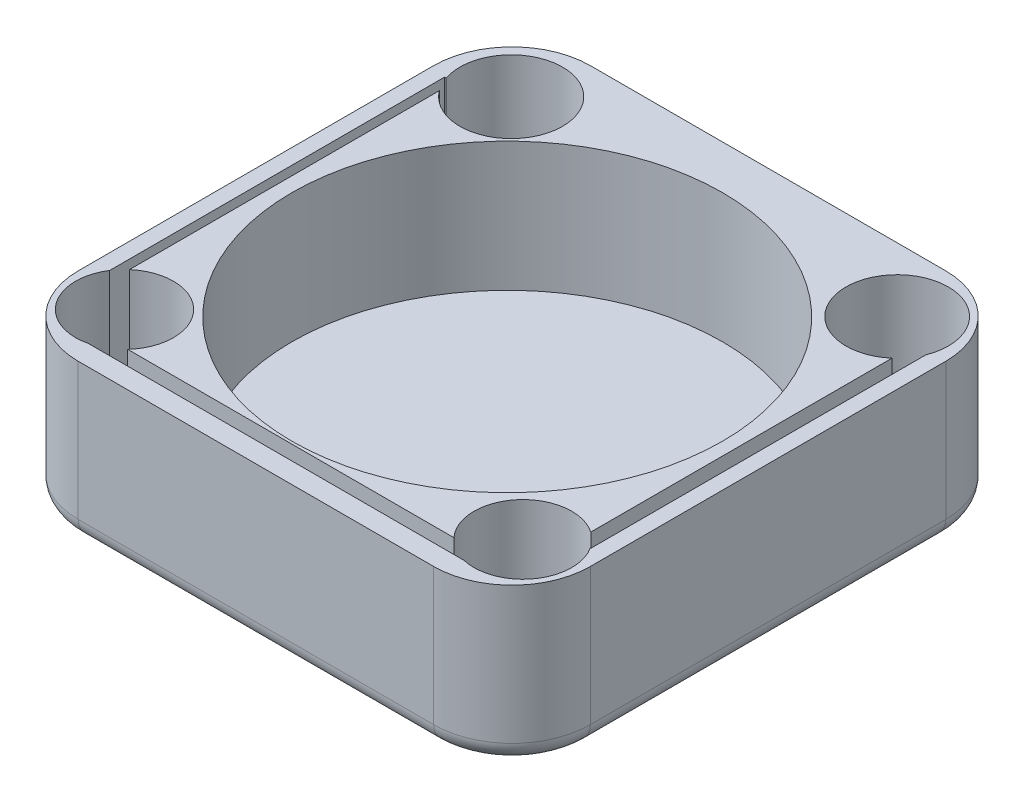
ISO-10303-21;
HEADER;
FILE_DESCRIPTION(('STEP AP214'),'2;1');
FILE_NAME('part.step','',(''),(''),'','','');
FILE_SCHEMA(('AUTOMOTIVE_DESIGN { 1 0 10303 214 1 1 1 1 }'));
ENDSEC;
DATA;
#1=APPLICATION_CONTEXT('core data for automotive mechanical design processes');
#2=APPLICATION_PROTOCOL_DEFINITION('international standard','automotive_design',2000,#1);
#3=PRODUCT_CONTEXT('',#1,'mechanical');
#4=PRODUCT('Part','Part','',(#3));
#5=PRODUCT_RELATED_PRODUCT_CATEGORY('part','',(#4));
#6=PRODUCT_DEFINITION_FORMATION('','',#4);
#7=PRODUCT_DEFINITION_CONTEXT('part definition',#1,'design');
#8=PRODUCT_DEFINITION('design','',#6,#7);
#9=PRODUCT_DEFINITION_SHAPE('','',#8);
#10=(LENGTH_UNIT() NAMED_UNIT(*) SI_UNIT(.MILLI.,.METRE.));
#11=(NAMED_UNIT(*) PLANE_ANGLE_UNIT() SI_UNIT($,.RADIAN.));
#12=(NAMED_UNIT(*) SI_UNIT($,.STERADIAN.) SOLID_ANGLE_UNIT());
#13=UNCERTAINTY_MEASURE_WITH_UNIT(LENGTH_MEASURE(1.E-05),#10,'distance_accuracy_value','');
#14=(GEOMETRIC_REPRESENTATION_CONTEXT(3) GLOBAL_UNCERTAINTY_ASSIGNED_CONTEXT((#13)) GLOBAL_UNIT_ASSIGNED_CONTEXT((#10,
#11,#12)) REPRESENTATION_CONTEXT('',''));
#15=CARTESIAN_POINT('',(0.,0.,0.));
#16=DIRECTION('',(0.,0.,1.));
#17=DIRECTION('',(1.,0.,0.));
#18=AXIS2_PLACEMENT_3D('',#15,#16,#17);
#19=CARTESIAN_POINT('',(-18.3773022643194,7.00000000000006,61.4690769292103));
#20=DIRECTION('',(0.,1.,0.));
#21=DIRECTION('',(0.,0.,1.));
#22=AXIS2_PLACEMENT_3D('',#19,#20,#21);
#23=CYLINDRICAL_SURFACE('',#22,12.498125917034);
#24=CARTESIAN_POINT('',(-18.3773022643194,40.0000000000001,61.4690769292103));
#25=DIRECTION('',(0.,1.,0.));
#26=DIRECTION('',(0.,0.,1.));
#27=AXIS2_PLACEMENT_3D('',#24,#25,#26);
#28=CIRCLE('',#27,12.498125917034);
#29=CARTESIAN_POINT('',(-9.14142279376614,40.0000000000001,69.8893905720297));
#30=VERTEX_POINT('',#29);
#31=CARTESIAN_POINT('',(-26.5583823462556,40.0000000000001,52.02063366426));
#32=VERTEX_POINT('',#31);
#33=EDGE_CURVE('E656',#30,#32,#28,.T.);
#34=ORIENTED_EDGE('',*,*,#33,.T.);
#35=DIRECTION('',(0.,1.,0.));
#36=VECTOR('',#35,1.);
#37=CARTESIAN_POINT('',(-26.5583823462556,7.00000000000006,52.02063366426));
#38=LINE('',#37,#36);
#39=CARTESIAN_POINT('',(-26.5583823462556,7.00000000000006,52.02063366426));
#40=VERTEX_POINT('',#39);
#41=EDGE_CURVE('E11',#32,#40,#38,.F.);
#42=ORIENTED_EDGE('',*,*,#41,.T.);
#43=CARTESIAN_POINT('',(-18.3773022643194,7.00000000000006,61.4690769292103));
#44=DIRECTION('',(0.,1.,0.));
#45=DIRECTION('',(0.,0.,1.));
#46=AXIS2_PLACEMENT_3D('',#43,#44,#45);
#47=CIRCLE('',#46,12.498125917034);
#48=CARTESIAN_POINT('',(-9.14142279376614,7.00000000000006,69.8893905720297));
#49=VERTEX_POINT('',#48);
#50=EDGE_CURVE('E660',#49,#40,#47,.T.);
#51=ORIENTED_EDGE('',*,*,#50,.F.);
#52=DIRECTION('',(0.,1.,0.));
#53=VECTOR('',#52,1.);
#54=CARTESIAN_POINT('',(-9.14142279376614,7.00000000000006,69.8893905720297));
#55=LINE('',#54,#53);
#56=EDGE_CURVE('E619',#49,#30,#55,.T.);
#57=ORIENTED_EDGE('',*,*,#56,.T.);
#58=EDGE_LOOP('',(#34,#42,#51,#57));
#59=FACE_BOUND('',#58,.T.);
#60=ADVANCED_FACE('F351',(#59),#23,.F.);
#61=CARTESIAN_POINT('',(83.3776914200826,7.00000000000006,61.4690769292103));
#62=DIRECTION('',(0.,1.,0.));
#63=DIRECTION('',(0.,0.,1.));
#64=AXIS2_PLACEMENT_3D('',#61,#62,#63);
#65=CYLINDRICAL_SURFACE('',#64,12.479433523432);
#66=CARTESIAN_POINT('',(83.3776914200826,7.00000000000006,61.4690769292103));
#67=DIRECTION('',(0.,1.,0.));
#68=DIRECTION('',(0.,0.,1.));
#69=AXIS2_PLACEMENT_3D('',#66,#67,#68);
#70=CIRCLE('',#69,12.479433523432);
#71=CARTESIAN_POINT('',(80.5259033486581,7.00000000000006,73.6182977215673));
#72=VERTEX_POINT('',#71);
#73=CARTESIAN_POINT('',(93.8772460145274,7.00000000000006,54.7240332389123));
#74=VERTEX_POINT('',#73);
#75=EDGE_CURVE('E666',#72,#74,#70,.T.);
#76=ORIENTED_EDGE('',*,*,#75,.F.);
#77=DIRECTION('',(0.,1.,0.));
#78=VECTOR('',#77,1.);
#79=CARTESIAN_POINT('',(80.5259033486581,7.00000000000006,73.6182977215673));
#80=LINE('',#79,#78);
#81=CARTESIAN_POINT('',(80.5259033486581,40.0000000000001,73.6182977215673));
#82=VERTEX_POINT('',#81);
#83=EDGE_CURVE('E616',#72,#82,#80,.T.);
#84=ORIENTED_EDGE('',*,*,#83,.T.);
#85=CARTESIAN_POINT('',(83.3776914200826,40.0000000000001,61.4690769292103));
#86=DIRECTION('',(0.,1.,0.));
#87=DIRECTION('',(0.,0.,1.));
#88=AXIS2_PLACEMENT_3D('',#85,#86,#87);
#89=CIRCLE('',#88,12.479433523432);
#90=CARTESIAN_POINT('',(93.8772460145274,40.0000000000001,54.7240332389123));
#91=VERTEX_POINT('',#90);
#92=EDGE_CURVE('E662',#82,#91,#89,.T.);
#93=ORIENTED_EDGE('',*,*,#92,.T.);
#94=DIRECTION('',(0.,1.,0.));
#95=VECTOR('',#94,1.);
#96=CARTESIAN_POINT('',(93.8772460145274,7.00000000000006,54.7240332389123));
#97=LINE('',#96,#95);
#98=EDGE_CURVE('E653',#91,#74,#97,.F.);
#99=ORIENTED_EDGE('',*,*,#98,.T.);
#100=EDGE_LOOP('',(#76,#84,#93,#99));
#101=FACE_BOUND('',#100,.T.);
#102=ADVANCED_FACE('F927',(#101),#65,.F.);
#103=CARTESIAN_POINT('',(97.9730137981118,0.,78.8437182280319));
#104=DIRECTION('',(0.,-1.,0.));
#105=DIRECTION('',(0.,0.,-1.));
#106=AXIS2_PLACEMENT_3D('',#103,#104,#105);
#107=PLANE('',#106);
#108=DIRECTION('',(0.,0.,-1.));
#109=VECTOR('',#108,1.);
#110=CARTESIAN_POINT('',(-12.8300072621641,0.,-31.959302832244));
#111=LINE('',#110,#109);
#112=CARTESIAN_POINT('',(-12.8300072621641,0.,58.8437182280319));
#113=VERTEX_POINT('',#112);
#114=CARTESIAN_POINT('',(-12.8300072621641,0.,-31.959302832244));
#115=VERTEX_POINT('',#114);
#116=EDGE_CURVE('E680',#113,#115,#111,.T.);
#117=ORIENTED_EDGE('',*,*,#116,.F.);
#118=DIRECTION('',(-1.,0.,0.));
#119=VECTOR('',#118,1.);
#120=CARTESIAN_POINT('',(-12.8300072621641,0.,58.8437182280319));
#121=LINE('',#120,#119);
#122=CARTESIAN_POINT('',(-2.54679560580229,0.,58.8437182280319));
#123=VERTEX_POINT('',#122);
#124=EDGE_CURVE('E688',#123,#113,#121,.T.);
#125=ORIENTED_EDGE('',*,*,#124,.F.);
#126=DIRECTION('',(0.,0.,1.));
#127=VECTOR('',#126,1.);
#128=CARTESIAN_POINT('',(-2.54679560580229,0.,-31.959302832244));
#129=LINE('',#128,#127);
#130=CARTESIAN_POINT('',(-2.54679560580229,0.,-31.959302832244));
#131=VERTEX_POINT('',#130);
#132=EDGE_CURVE('E685',#131,#123,#129,.T.);
#133=ORIENTED_EDGE('',*,*,#132,.F.);
#134=DIRECTION('',(1.,0.,0.));
#135=VECTOR('',#134,1.);
#136=CARTESIAN_POINT('',(-12.8300072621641,0.,-31.959302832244));
#137=LINE('',#136,#135);
#138=EDGE_CURVE('E682',#115,#131,#137,.T.);
#139=ORIENTED_EDGE('',*,*,#138,.F.);
#140=EDGE_LOOP('',(#117,#125,#133,#139));
#141=FACE_BOUND('',#140,.T.);
#142=DIRECTION('',(0.,0.,1.));
#143=VECTOR('',#142,1.);
#144=CARTESIAN_POINT('',(77.9730137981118,0.,-31.959302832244));
#145=LINE('',#144,#143);
#146=CARTESIAN_POINT('',(77.9730137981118,0.,-31.959302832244));
#147=VERTEX_POINT('',#146);
#148=CARTESIAN_POINT('',(77.9730137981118,0.,58.8437182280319));
#149=VERTEX_POINT('',#148);
#150=EDGE_CURVE('E706',#147,#149,#145,.T.);
#151=ORIENTED_EDGE('',*,*,#150,.F.);
#152=DIRECTION('',(1.,0.,0.));
#153=VECTOR('',#152,1.);
#154=CARTESIAN_POINT('',(77.9730137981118,0.,-31.959302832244));
#155=LINE('',#154,#153);
#156=CARTESIAN_POINT('',(67.8391359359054,0.,-31.959302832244));
#157=VERTEX_POINT('',#156);
#158=EDGE_CURVE('E720',#157,#147,#155,.T.);
#159=ORIENTED_EDGE('',*,*,#158,.F.);
#160=DIRECTION('',(0.,0.,-1.));
#161=VECTOR('',#160,1.);
#162=CARTESIAN_POINT('',(67.8391359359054,0.,-31.959302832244));
#163=LINE('',#162,#161);
#164=CARTESIAN_POINT('',(67.8391359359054,0.,58.8437182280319));
#165=VERTEX_POINT('',#164);
#166=EDGE_CURVE('E717',#165,#157,#163,.T.);
#167=ORIENTED_EDGE('',*,*,#166,.F.);
#168=DIRECTION('',(-1.,0.,0.));
#169=VECTOR('',#168,1.);
#170=CARTESIAN_POINT('',(77.9730137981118,0.,58.8437182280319));
#171=LINE('',#170,#169);
#172=EDGE_CURVE('E714',#149,#165,#171,.T.);
#173=ORIENTED_EDGE('',*,*,#172,.F.);
#174=EDGE_LOOP('',(#151,#159,#167,#173));
#175=FACE_BOUND('',#174,.T.);
#176=CARTESIAN_POINT('',(77.9730137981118,0.,58.8437182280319));
#177=DIRECTION('',(0.,-1.,0.));
#178=DIRECTION('',(0.,0.,-1.));
#179=AXIS2_PLACEMENT_3D('',#176,#177,#178);
#180=CIRCLE('',#179,15.);
#181=CARTESIAN_POINT('',(77.9730137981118,0.,73.8437182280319));
#182=VERTEX_POINT('',#181);
#183=CARTESIAN_POINT('',(92.9730137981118,0.,58.8437182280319));
#184=VERTEX_POINT('',#183);
#185=EDGE_CURVE('E834',#182,#184,#180,.F.);
#186=ORIENTED_EDGE('',*,*,#185,.F.);
#187=DIRECTION('',(1.,0.,0.));
#188=VECTOR('',#187,1.);
#189=CARTESIAN_POINT('',(-12.8300072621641,0.,73.8437182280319));
#190=LINE('',#189,#188);
#191=CARTESIAN_POINT('',(-12.8300072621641,0.,73.8437182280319));
#192=VERTEX_POINT('',#191);
#193=EDGE_CURVE('E809',#182,#192,#190,.F.);
#194=ORIENTED_EDGE('',*,*,#193,.T.);
#195=CARTESIAN_POINT('',(-12.8300072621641,0.,58.8437182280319));
#196=DIRECTION('',(0.,-1.,0.));
#197=DIRECTION('',(0.,0.,-1.));
#198=AXIS2_PLACEMENT_3D('',#195,#196,#197);
#199=CIRCLE('',#198,15.);
#200=CARTESIAN_POINT('',(-27.8300072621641,0.,58.8437182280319));
#201=VERTEX_POINT('',#200);
#202=EDGE_CURVE('E811',#192,#201,#199,.T.);
#203=ORIENTED_EDGE('',*,*,#202,.T.);
#204=DIRECTION('',(0.,0.,1.));
#205=VECTOR('',#204,1.);
#206=CARTESIAN_POINT('',(-27.8300072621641,0.,-31.959302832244));
#207=LINE('',#206,#205);
#208=CARTESIAN_POINT('',(-27.8300072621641,0.,-31.959302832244));
#209=VERTEX_POINT('',#208);
#210=EDGE_CURVE('E813',#201,#209,#207,.F.);
#211=ORIENTED_EDGE('',*,*,#210,.T.);
#212=CARTESIAN_POINT('',(-12.8300072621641,0.,-31.959302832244));
#213=DIRECTION('',(0.,-1.,0.));
#214=DIRECTION('',(0.,0.,-1.));
#215=AXIS2_PLACEMENT_3D('',#212,#213,#214);
#216=CIRCLE('',#215,15.);
#217=CARTESIAN_POINT('',(-12.8300072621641,0.,-46.959302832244));
#218=VERTEX_POINT('',#217);
#219=EDGE_CURVE('E815',#209,#218,#216,.T.);
#220=ORIENTED_EDGE('',*,*,#219,.T.);
#221=DIRECTION('',(-1.,0.,0.));
#222=VECTOR('',#221,1.);
#223=CARTESIAN_POINT('',(77.9730137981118,0.,-46.959302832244));
#224=LINE('',#223,#222);
#225=CARTESIAN_POINT('',(77.9730137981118,0.,-46.959302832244));
#226=VERTEX_POINT('',#225);
#227=EDGE_CURVE('E802',#218,#226,#224,.F.);
#228=ORIENTED_EDGE('',*,*,#227,.T.);
#229=CARTESIAN_POINT('',(77.9730137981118,0.,-31.959302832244));
#230=DIRECTION('',(0.,-1.,0.));
#231=DIRECTION('',(0.,0.,-1.));
#232=AXIS2_PLACEMENT_3D('',#229,#230,#231);
#233=CIRCLE('',#232,15.);
#234=CARTESIAN_POINT('',(92.9730137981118,0.,-31.959302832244));
#235=VERTEX_POINT('',#234);
#236=EDGE_CURVE('E804',#226,#235,#233,.T.);
#237=ORIENTED_EDGE('',*,*,#236,.T.);
#238=DIRECTION('',(0.,0.,-1.));
#239=VECTOR('',#238,1.);
#240=CARTESIAN_POINT('',(92.9730137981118,0.,78.8437182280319));
#241=LINE('',#240,#239);
#242=EDGE_CURVE('E806',#235,#184,#241,.F.);
#243=ORIENTED_EDGE('',*,*,#242,.T.);
#244=EDGE_LOOP('',(#186,#194,#203,#211,#220,#228,#237,#243));
#245=FACE_BOUND('',#244,.T.);
#246=ADVANCED_FACE('F866',(#141,#175,#245),#107,.T.);
#247=CARTESIAN_POINT('',(97.9730137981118,40.0000000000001,-51.959302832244));
#248=DIRECTION('',(-1.,0.,0.));
#249=DIRECTION('',(0.,0.,1.));
#250=AXIS2_PLACEMENT_3D('',#247,#248,#249);
#251=PLANE('',#250);
#252=DIRECTION('',(0.,0.,-1.));
#253=VECTOR('',#252,1.);
#254=CARTESIAN_POINT('',(97.9730137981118,40.0000000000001,-51.959302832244));
#255=LINE('',#254,#253);
#256=CARTESIAN_POINT('',(97.9730137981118,40.0000000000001,58.8437182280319));
#257=VERTEX_POINT('',#256);
#258=CARTESIAN_POINT('',(97.9730137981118,40.0000000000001,-31.959302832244));
#259=VERTEX_POINT('',#258);
#260=EDGE_CURVE('E769',#257,#259,#255,.T.);
#261=ORIENTED_EDGE('',*,*,#260,.F.);
#262=DIRECTION('',(0.,-1.,0.));
#263=VECTOR('',#262,1.);
#264=CARTESIAN_POINT('',(97.9730137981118,40.0000000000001,58.8437182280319));
#265=LINE('',#264,#263);
#266=CARTESIAN_POINT('',(97.9730137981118,5.,58.8437182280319));
#267=VERTEX_POINT('',#266);
#268=EDGE_CURVE('E841',#257,#267,#265,.T.);
#269=ORIENTED_EDGE('',*,*,#268,.T.);
#270=DIRECTION('',(0.,0.,-1.));
#271=VECTOR('',#270,1.);
#272=CARTESIAN_POINT('',(97.9730137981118,5.,-31.959302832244));
#273=LINE('',#272,#271);
#274=CARTESIAN_POINT('',(97.9730137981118,5.,-31.959302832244));
#275=VERTEX_POINT('',#274);
#276=EDGE_CURVE('E828',#267,#275,#273,.T.);
#277=ORIENTED_EDGE('',*,*,#276,.T.);
#278=DIRECTION('',(0.,-1.,0.));
#279=VECTOR('',#278,1.);
#280=CARTESIAN_POINT('',(97.9730137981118,40.0000000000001,-31.959302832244));
#281=LINE('',#280,#279);
#282=EDGE_CURVE('E797',#275,#259,#281,.F.);
#283=ORIENTED_EDGE('',*,*,#282,.T.);
#284=EDGE_LOOP('',(#261,#269,#277,#283));
#285=FACE_BOUND('',#284,.T.);
#286=ADVANCED_FACE('F353',(#285),#251,.F.);
#287=CARTESIAN_POINT('',(97.9730137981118,40.0000000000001,-51.959302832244));
#288=DIRECTION('',(0.,0.,1.));
#289=DIRECTION('',(1.,0.,0.));
#290=AXIS2_PLACEMENT_3D('',#287,#288,#289);
#291=PLANE('',#290);
#292=DIRECTION('',(0.,-1.,0.));
#293=VECTOR('',#292,1.);
#294=CARTESIAN_POINT('',(77.9730137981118,40.0000000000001,-51.959302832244));
#295=LINE('',#294,#293);
#296=CARTESIAN_POINT('',(77.9730137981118,40.0000000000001,-51.959302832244));
#297=VERTEX_POINT('',#296);
#298=CARTESIAN_POINT('',(77.9730137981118,5.,-51.959302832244));
#299=VERTEX_POINT('',#298);
#300=EDGE_CURVE('E794',#297,#299,#295,.T.);
#301=ORIENTED_EDGE('',*,*,#300,.T.);
#302=DIRECTION('',(-1.,0.,0.));
#303=VECTOR('',#302,1.);
#304=CARTESIAN_POINT('',(-12.8300072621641,5.,-51.959302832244));
#305=LINE('',#304,#303);
#306=CARTESIAN_POINT('',(-12.8300072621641,5.,-51.959302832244));
#307=VERTEX_POINT('',#306);
#308=EDGE_CURVE('E832',#299,#307,#305,.T.);
#309=ORIENTED_EDGE('',*,*,#308,.T.);
#310=DIRECTION('',(0.,-1.,0.));
#311=VECTOR('',#310,1.);
#312=CARTESIAN_POINT('',(-12.8300072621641,40.0000000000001,-51.959302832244));
#313=LINE('',#312,#311);
#314=CARTESIAN_POINT('',(-12.8300072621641,40.0000000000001,-51.959302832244));
#315=VERTEX_POINT('',#314);
#316=EDGE_CURVE('E790',#307,#315,#313,.F.);
#317=ORIENTED_EDGE('',*,*,#316,.T.);
#318=DIRECTION('',(-1.,0.,0.));
#319=VECTOR('',#318,1.);
#320=CARTESIAN_POINT('',(97.9730137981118,40.0000000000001,-51.959302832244));
#321=LINE('',#320,#319);
#322=EDGE_CURVE('E771',#297,#315,#321,.T.);
#323=ORIENTED_EDGE('',*,*,#322,.F.);
#324=EDGE_LOOP('',(#301,#309,#317,#323));
#325=FACE_BOUND('',#324,.T.);
#326=ADVANCED_FACE('F880',(#325),#291,.F.);
#327=CARTESIAN_POINT('',(-32.8300072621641,40.0000000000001,-51.959302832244));
#328=DIRECTION('',(1.,0.,0.));
#329=DIRECTION('',(0.,0.,-1.));
#330=AXIS2_PLACEMENT_3D('',#327,#328,#329);
#331=PLANE('',#330);
#332=DIRECTION('',(0.,-1.,0.));
#333=VECTOR('',#332,1.);
#334=CARTESIAN_POINT('',(-32.8300072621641,40.0000000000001,-31.959302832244));
#335=LINE('',#334,#333);
#336=CARTESIAN_POINT('',(-32.8300072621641,40.0000000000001,-31.959302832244));
#337=VERTEX_POINT('',#336);
#338=CARTESIAN_POINT('',(-32.8300072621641,5.,-31.959302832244));
#339=VERTEX_POINT('',#338);
#340=EDGE_CURVE('E787',#337,#339,#335,.T.);
#341=ORIENTED_EDGE('',*,*,#340,.T.);
#342=DIRECTION('',(0.,0.,1.));
#343=VECTOR('',#342,1.);
#344=CARTESIAN_POINT('',(-32.8300072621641,5.,58.8437182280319));
#345=LINE('',#344,#343);
#346=CARTESIAN_POINT('',(-32.8300072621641,5.,58.8437182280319));
#347=VERTEX_POINT('',#346);
#348=EDGE_CURVE('E821',#339,#347,#345,.T.);
#349=ORIENTED_EDGE('',*,*,#348,.T.);
#350=DIRECTION('',(0.,-1.,0.));
#351=VECTOR('',#350,1.);
#352=CARTESIAN_POINT('',(-32.8300072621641,40.0000000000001,58.8437182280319));
#353=LINE('',#352,#351);
#354=CARTESIAN_POINT('',(-32.8300072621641,40.0000000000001,58.8437182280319));
#355=VERTEX_POINT('',#354);
#356=EDGE_CURVE('E783',#347,#355,#353,.F.);
#357=ORIENTED_EDGE('',*,*,#356,.T.);
#358=DIRECTION('',(0.,0.,1.));
#359=VECTOR('',#358,1.);
#360=CARTESIAN_POINT('',(-32.8300072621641,40.0000000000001,-51.959302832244));
#361=LINE('',#360,#359);
#362=EDGE_CURVE('E774',#337,#355,#361,.T.);
#363=ORIENTED_EDGE('',*,*,#362,.F.);
#364=EDGE_LOOP('',(#341,#349,#357,#363));
#365=FACE_BOUND('',#364,.T.);
#366=ADVANCED_FACE('F899',(#365),#331,.F.);
#367=CARTESIAN_POINT('',(97.9730137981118,40.0000000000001,78.8437182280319));
#368=DIRECTION('',(0.,0.,-1.));
#369=DIRECTION('',(-1.,0.,0.));
#370=AXIS2_PLACEMENT_3D('',#367,#368,#369);
#371=PLANE('',#370);
#372=DIRECTION('',(1.,0.,0.));
#373=VECTOR('',#372,1.);
#374=CARTESIAN_POINT('',(97.9730137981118,5.,78.8437182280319));
#375=LINE('',#374,#373);
#376=CARTESIAN_POINT('',(-12.8300072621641,5.,78.8437182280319));
#377=VERTEX_POINT('',#376);
#378=CARTESIAN_POINT('',(77.9730137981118,5.,78.8437182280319));
#379=VERTEX_POINT('',#378);
#380=EDGE_CURVE('E825',#377,#379,#375,.T.);
#381=ORIENTED_EDGE('',*,*,#380,.T.);
#382=DIRECTION('',(0.,-1.,0.));
#383=VECTOR('',#382,1.);
#384=CARTESIAN_POINT('',(77.9730137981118,40.0000000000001,78.8437182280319));
#385=LINE('',#384,#383);
#386=CARTESIAN_POINT('',(77.9730137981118,40.0000000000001,78.8437182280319));
#387=VERTEX_POINT('',#386);
#388=EDGE_CURVE('E843',#379,#387,#385,.F.);
#389=ORIENTED_EDGE('',*,*,#388,.T.);
#390=DIRECTION('',(1.,0.,0.));
#391=VECTOR('',#390,1.);
#392=CARTESIAN_POINT('',(97.9730137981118,40.0000000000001,78.8437182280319));
#393=LINE('',#392,#391);
#394=CARTESIAN_POINT('',(-12.8300072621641,40.0000000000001,78.8437182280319));
#395=VERTEX_POINT('',#394);
#396=EDGE_CURVE('E777',#395,#387,#393,.T.);
#397=ORIENTED_EDGE('',*,*,#396,.F.);
#398=DIRECTION('',(0.,-1.,0.));
#399=VECTOR('',#398,1.);
#400=CARTESIAN_POINT('',(-12.8300072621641,40.0000000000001,78.8437182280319));
#401=LINE('',#400,#399);
#402=EDGE_CURVE('E780',#395,#377,#401,.T.);
#403=ORIENTED_EDGE('',*,*,#402,.T.);
#404=EDGE_LOOP('',(#381,#389,#397,#403));
#405=FACE_BOUND('',#404,.T.);
#406=ADVANCED_FACE('F914',(#405),#371,.F.);
#407=CARTESIAN_POINT('',(97.9730137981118,40.0000000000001,78.8437182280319));
#408=DIRECTION('',(0.,-1.,0.));
#409=DIRECTION('',(0.,0.,-1.));
#410=AXIS2_PLACEMENT_3D('',#407,#408,#409);
#411=PLANE('',#410);
#412=CARTESIAN_POINT('',(-16.0509096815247,40.0000000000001,-34.9745824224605));
#413=DIRECTION('',(0.,1.,0.));
#414=DIRECTION('',(0.,0.,1.));
#415=AXIS2_PLACEMENT_3D('',#412,#413,#414);
#416=CIRCLE('',#415,13.119532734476);
#417=CARTESIAN_POINT('',(-26.5583823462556,40.0000000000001,-27.1186828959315));
#418=VERTEX_POINT('',#417);
#419=CARTESIAN_POINT('',(-28.4959855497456,40.0000000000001,-30.8222064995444));
#420=VERTEX_POINT('',#419);
#421=EDGE_CURVE('E669',#418,#420,#416,.T.);
#422=ORIENTED_EDGE('',*,*,#421,.F.);
#423=DIRECTION('',(0.,0.,-1.));
#424=VECTOR('',#423,1.);
#425=CARTESIAN_POINT('',(-26.5583823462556,40.0000000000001,-30.8222064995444));
#426=LINE('',#425,#424);
#427=EDGE_CURVE('E583',#32,#418,#426,.T.);
#428=ORIENTED_EDGE('',*,*,#427,.F.);
#429=ORIENTED_EDGE('',*,*,#33,.F.);
#430=DIRECTION('',(-1.,0.,0.));
#431=VECTOR('',#430,1.);
#432=CARTESIAN_POINT('',(80.5259033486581,40.0000000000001,69.8893905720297));
#433=LINE('',#432,#431);
#434=CARTESIAN_POINT('',(74.1671225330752,40.0000000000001,69.8893905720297));
#435=VERTEX_POINT('',#434);
#436=EDGE_CURVE('E609',#435,#30,#433,.T.);
#437=ORIENTED_EDGE('',*,*,#436,.F.);
#438=CARTESIAN_POINT('',(90.4220938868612,40.0000000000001,51.167977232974));
#439=VERTEX_POINT('',#438);
#440=EDGE_CURVE('E663',#439,#435,#89,.T.);
#441=ORIENTED_EDGE('',*,*,#440,.F.);
#442=DIRECTION('',(0.,0.,1.));
#443=VECTOR('',#442,1.);
#444=CARTESIAN_POINT('',(90.4220938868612,40.0000000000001,-30.8222064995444));
#445=LINE('',#444,#443);
#446=CARTESIAN_POINT('',(90.4220938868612,40.0000000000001,-25.7610328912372));
#447=VERTEX_POINT('',#446);
#448=EDGE_CURVE('E630',#447,#439,#445,.T.);
#449=ORIENTED_EDGE('',*,*,#448,.F.);
#450=CARTESIAN_POINT('',(81.8620464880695,40.0000000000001,-35.6528724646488));
#451=DIRECTION('',(0.,1.,0.));
#452=DIRECTION('',(0.,0.,1.));
#453=AXIS2_PLACEMENT_3D('',#450,#451,#452);
#454=CIRCLE('',#453,13.0813952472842);
#455=CARTESIAN_POINT('',(94.0188375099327,40.0000000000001,-30.8222064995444));
#456=VERTEX_POINT('',#455);
#457=EDGE_CURVE('E674',#456,#447,#454,.T.);
#458=ORIENTED_EDGE('',*,*,#457,.F.);
#459=DIRECTION('',(0.,0.,-1.));
#460=VECTOR('',#459,1.);
#461=CARTESIAN_POINT('',(94.0188375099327,40.0000000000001,-30.8222064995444));
#462=LINE('',#461,#460);
#463=CARTESIAN_POINT('',(94.0188375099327,40.0000000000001,54.7240332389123));
#464=VERTEX_POINT('',#463);
#465=EDGE_CURVE('E628',#464,#456,#462,.T.);
#466=ORIENTED_EDGE('',*,*,#465,.F.);
#467=DIRECTION('',(1.,0.,0.));
#468=VECTOR('',#467,1.);
#469=CARTESIAN_POINT('',(94.0188375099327,40.0000000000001,54.7240332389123));
#470=LINE('',#469,#468);
#471=EDGE_CURVE('E632',#91,#464,#470,.T.);
#472=ORIENTED_EDGE('',*,*,#471,.F.);
#473=ORIENTED_EDGE('',*,*,#92,.F.);
#474=DIRECTION('',(1.,0.,0.));
#475=VECTOR('',#474,1.);
#476=CARTESIAN_POINT('',(80.5259033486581,40.0000000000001,73.6182977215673));
#477=LINE('',#476,#475);
#478=CARTESIAN_POINT('',(-15.444797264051,40.0000000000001,73.6182977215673));
#479=VERTEX_POINT('',#478);
#480=EDGE_CURVE('E611',#479,#82,#477,.T.);
#481=ORIENTED_EDGE('',*,*,#480,.F.);
#482=CARTESIAN_POINT('',(-28.8990671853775,40.0000000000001,54.7240332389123));
#483=VERTEX_POINT('',#482);
#484=EDGE_CURVE('E594',#483,#479,#28,.T.);
#485=ORIENTED_EDGE('',*,*,#484,.F.);
#486=DIRECTION('',(0.,0.,1.));
#487=VECTOR('',#486,1.);
#488=CARTESIAN_POINT('',(-28.8990671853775,40.0000000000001,-30.8222064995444));
#489=LINE('',#488,#487);
#490=CARTESIAN_POINT('',(-28.8990671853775,40.0000000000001,-30.8222064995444));
#491=VERTEX_POINT('',#490);
#492=EDGE_CURVE('E582',#491,#483,#489,.T.);
#493=ORIENTED_EDGE('',*,*,#492,.F.);
#494=DIRECTION('',(-1.,0.,0.));
#495=VECTOR('',#494,1.);
#496=CARTESIAN_POINT('',(-26.5583823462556,40.0000000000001,-30.8222064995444));
#497=LINE('',#496,#495);
#498=EDGE_CURVE('E572',#420,#491,#497,.T.);
#499=ORIENTED_EDGE('',*,*,#498,.F.);
#500=EDGE_LOOP('',(#422,#428,#429,#437,#441,#449,#458,#466,#472,#473,#481,#485,#493,#499));
#501=FACE_BOUND('',#500,.T.);
#502=CARTESIAN_POINT('',(32.1558200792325,40.0000000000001,14.2479989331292));
#503=DIRECTION('',(0.,1.,0.));
#504=DIRECTION('',(0.,0.,1.));
#505=AXIS2_PLACEMENT_3D('',#502,#503,#504);
#506=CIRCLE('',#505,55.);
#507=CARTESIAN_POINT('',(32.1558200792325,40.0000000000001,69.2479989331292));
#508=VERTEX_POINT('',#507);
#509=EDGE_CURVE('E763',#508,#508,#506,.T.);
#510=ORIENTED_EDGE('',*,*,#509,.F.);
#511=EDGE_LOOP('',(#510));
#512=FACE_BOUND('',#511,.T.);
#513=ORIENTED_EDGE('',*,*,#396,.T.);
#514=CARTESIAN_POINT('',(77.9730137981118,40.0000000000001,58.8437182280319));
#515=DIRECTION('',(0.,-1.,0.));
#516=DIRECTION('',(0.,0.,-1.));
#517=AXIS2_PLACEMENT_3D('',#514,#515,#516);
#518=CIRCLE('',#517,20.);
#519=EDGE_CURVE('E359',#387,#257,#518,.F.);
#520=ORIENTED_EDGE('',*,*,#519,.T.);
#521=ORIENTED_EDGE('',*,*,#260,.T.);
#522=CARTESIAN_POINT('',(77.9730137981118,40.0000000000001,-31.959302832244));
#523=DIRECTION('',(0.,-1.,0.));
#524=DIRECTION('',(0.,0.,-1.));
#525=AXIS2_PLACEMENT_3D('',#522,#523,#524);
#526=CIRCLE('',#525,20.);
#527=EDGE_CURVE('E800',#259,#297,#526,.F.);
#528=ORIENTED_EDGE('',*,*,#527,.T.);
#529=ORIENTED_EDGE('',*,*,#322,.T.);
#530=CARTESIAN_POINT('',(-12.8300072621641,40.0000000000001,-31.959302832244));
#531=DIRECTION('',(0.,-1.,0.));
#532=DIRECTION('',(0.,0.,-1.));
#533=AXIS2_PLACEMENT_3D('',#530,#531,#532);
#534=CIRCLE('',#533,20.);
#535=EDGE_CURVE('E792',#315,#337,#534,.F.);
#536=ORIENTED_EDGE('',*,*,#535,.T.);
#537=ORIENTED_EDGE('',*,*,#362,.T.);
#538=CARTESIAN_POINT('',(-12.8300072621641,40.0000000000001,58.8437182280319));
#539=DIRECTION('',(0.,-1.,0.));
#540=DIRECTION('',(0.,0.,-1.));
#541=AXIS2_PLACEMENT_3D('',#538,#539,#540);
#542=CIRCLE('',#541,20.);
#543=EDGE_CURVE('E785',#355,#395,#542,.F.);
#544=ORIENTED_EDGE('',*,*,#543,.T.);
#545=EDGE_LOOP('',(#513,#520,#521,#528,#529,#536,#537,#544));
#546=FACE_BOUND('',#545,.T.);
#547=ADVANCED_FACE('F591',(#501,#512,#546),#411,.F.);
#548=CARTESIAN_POINT('',(32.1558200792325,7.00000000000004,14.2479989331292));
#549=DIRECTION('',(0.,1.,0.));
#550=DIRECTION('',(0.,0.,1.));
#551=AXIS2_PLACEMENT_3D('',#548,#549,#550);
#552=CYLINDRICAL_SURFACE('',#551,55.);
#553=CARTESIAN_POINT('',(32.1558200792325,7.00000000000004,14.2479989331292));
#554=DIRECTION('',(0.,1.,0.));
#555=DIRECTION('',(0.,0.,1.));
#556=AXIS2_PLACEMENT_3D('',#553,#554,#555);
#557=CIRCLE('',#556,55.);
#558=CARTESIAN_POINT('',(32.1558200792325,7.00000000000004,69.2479989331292));
#559=VERTEX_POINT('',#558);
#560=EDGE_CURVE('E766',#559,#559,#557,.T.);
#561=ORIENTED_EDGE('',*,*,#560,.F.);
#562=EDGE_LOOP('',(#561));
#563=FACE_BOUND('',#562,.T.);
#564=ORIENTED_EDGE('',*,*,#509,.T.);
#565=EDGE_LOOP('',(#564));
#566=FACE_BOUND('',#565,.T.);
#567=ADVANCED_FACE('F922',(#563,#566),#552,.F.);
#568=CARTESIAN_POINT('',(32.1558200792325,7.00000000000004,14.2479989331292));
#569=DIRECTION('',(0.,1.,0.));
#570=DIRECTION('',(0.,0.,1.));
#571=AXIS2_PLACEMENT_3D('',#568,#569,#570);
#572=PLANE('',#571);
#573=ORIENTED_EDGE('',*,*,#560,.T.);
#574=EDGE_LOOP('',(#573));
#575=FACE_BOUND('',#574,.T.);
#576=ADVANCED_FACE('F1081',(#575),#572,.T.);
#577=CARTESIAN_POINT('',(-12.8300072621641,40.0000000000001,58.8437182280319));
#578=DIRECTION('',(0.,-1.,0.));
#579=DIRECTION('',(0.,0.,-1.));
#580=AXIS2_PLACEMENT_3D('',#577,#578,#579);
#581=CYLINDRICAL_SURFACE('',#580,20.);
#582=ORIENTED_EDGE('',*,*,#356,.F.);
#583=CARTESIAN_POINT('',(-12.8300072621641,5.,58.8437182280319));
#584=DIRECTION('',(0.,-1.,0.));
#585=DIRECTION('',(0.,0.,-1.));
#586=AXIS2_PLACEMENT_3D('',#583,#584,#585);
#587=CIRCLE('',#586,20.);
#588=EDGE_CURVE('E823',#347,#377,#587,.F.);
#589=ORIENTED_EDGE('',*,*,#588,.T.);
#590=ORIENTED_EDGE('',*,*,#402,.F.);
#591=ORIENTED_EDGE('',*,*,#543,.F.);
#592=EDGE_LOOP('',(#582,#589,#590,#591));
#593=FACE_BOUND('',#592,.T.);
#594=ADVANCED_FACE('F904',(#593),#581,.T.);
#595=CARTESIAN_POINT('',(-12.8300072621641,40.0000000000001,-31.959302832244));
#596=DIRECTION('',(0.,-1.,0.));
#597=DIRECTION('',(0.,0.,-1.));
#598=AXIS2_PLACEMENT_3D('',#595,#596,#597);
#599=CYLINDRICAL_SURFACE('',#598,20.);
#600=ORIENTED_EDGE('',*,*,#316,.F.);
#601=CARTESIAN_POINT('',(-12.8300072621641,5.,-31.959302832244));
#602=DIRECTION('',(0.,-1.,0.));
#603=DIRECTION('',(0.,0.,-1.));
#604=AXIS2_PLACEMENT_3D('',#601,#602,#603);
#605=CIRCLE('',#604,20.);
#606=EDGE_CURVE('E818',#307,#339,#605,.F.);
#607=ORIENTED_EDGE('',*,*,#606,.T.);
#608=ORIENTED_EDGE('',*,*,#340,.F.);
#609=ORIENTED_EDGE('',*,*,#535,.F.);
#610=EDGE_LOOP('',(#600,#607,#608,#609));
#611=FACE_BOUND('',#610,.T.);
#612=ADVANCED_FACE('F886',(#611),#599,.T.);
#613=CARTESIAN_POINT('',(77.9730137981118,40.0000000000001,-31.959302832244));
#614=DIRECTION('',(0.,-1.,0.));
#615=DIRECTION('',(0.,0.,-1.));
#616=AXIS2_PLACEMENT_3D('',#613,#614,#615);
#617=CYLINDRICAL_SURFACE('',#616,20.);
#618=ORIENTED_EDGE('',*,*,#282,.F.);
#619=CARTESIAN_POINT('',(77.9730137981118,5.,-31.959302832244));
#620=DIRECTION('',(0.,-1.,0.));
#621=DIRECTION('',(0.,0.,-1.));
#622=AXIS2_PLACEMENT_3D('',#619,#620,#621);
#623=CIRCLE('',#622,20.);
#624=EDGE_CURVE('E830',#275,#299,#623,.F.);
#625=ORIENTED_EDGE('',*,*,#624,.T.);
#626=ORIENTED_EDGE('',*,*,#300,.F.);
#627=ORIENTED_EDGE('',*,*,#527,.F.);
#628=EDGE_LOOP('',(#618,#625,#626,#627));
#629=FACE_BOUND('',#628,.T.);
#630=ADVANCED_FACE('F1103',(#629),#617,.T.);
#631=CARTESIAN_POINT('',(97.9730137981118,5.,73.8437182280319));
#632=DIRECTION('',(-1.,0.,0.));
#633=DIRECTION('',(0.,0.,1.));
#634=AXIS2_PLACEMENT_3D('',#631,#632,#633);
#635=CYLINDRICAL_SURFACE('',#634,5.);
#636=ORIENTED_EDGE('',*,*,#193,.F.);
#637=CARTESIAN_POINT('',(77.9730137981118,5.,73.8437182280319));
#638=DIRECTION('',(-1.,0.,0.));
#639=DIRECTION('',(0.,0.,1.));
#640=AXIS2_PLACEMENT_3D('',#637,#638,#639);
#641=CIRCLE('',#640,5.);
#642=EDGE_CURVE('E839',#182,#379,#641,.T.);
#643=ORIENTED_EDGE('',*,*,#642,.T.);
#644=ORIENTED_EDGE('',*,*,#380,.F.);
#645=CARTESIAN_POINT('',(-12.8300072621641,5.,73.8437182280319));
#646=DIRECTION('',(-1.,0.,0.));
#647=DIRECTION('',(0.,0.,1.));
#648=AXIS2_PLACEMENT_3D('',#645,#646,#647);
#649=CIRCLE('',#648,5.);
#650=EDGE_CURVE('E760',#192,#377,#649,.T.);
#651=ORIENTED_EDGE('',*,*,#650,.F.);
#652=EDGE_LOOP('',(#636,#643,#644,#651));
#653=FACE_BOUND('',#652,.T.);
#654=ADVANCED_FACE('F912',(#653),#635,.T.);
#655=CARTESIAN_POINT('',(92.9730137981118,5.,-51.959302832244));
#656=DIRECTION('',(0.,0.,1.));
#657=DIRECTION('',(1.,0.,0.));
#658=AXIS2_PLACEMENT_3D('',#655,#656,#657);
#659=CYLINDRICAL_SURFACE('',#658,5.);
#660=ORIENTED_EDGE('',*,*,#276,.F.);
#661=CARTESIAN_POINT('',(92.9730137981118,5.,58.8437182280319));
#662=DIRECTION('',(0.,0.,-1.));
#663=DIRECTION('',(-1.,0.,0.));
#664=AXIS2_PLACEMENT_3D('',#661,#662,#663);
#665=CIRCLE('',#664,5.);
#666=EDGE_CURVE('E837',#267,#184,#665,.T.);
#667=ORIENTED_EDGE('',*,*,#666,.T.);
#668=ORIENTED_EDGE('',*,*,#242,.F.);
#669=CARTESIAN_POINT('',(92.9730137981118,5.,-31.959302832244));
#670=DIRECTION('',(0.,0.,-1.));
#671=DIRECTION('',(-1.,0.,0.));
#672=AXIS2_PLACEMENT_3D('',#669,#670,#671);
#673=CIRCLE('',#672,5.);
#674=EDGE_CURVE('E757',#275,#235,#673,.T.);
#675=ORIENTED_EDGE('',*,*,#674,.F.);
#676=EDGE_LOOP('',(#660,#667,#668,#675));
#677=FACE_BOUND('',#676,.T.);
#678=ADVANCED_FACE('F863',(#677),#659,.T.);
#679=CARTESIAN_POINT('',(-12.8300072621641,5.,58.8437182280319));
#680=DIRECTION('',(0.,-1.,0.));
#681=DIRECTION('',(0.,0.,-1.));
#682=AXIS2_PLACEMENT_3D('',#679,#680,#681);
#683=TOROIDAL_SURFACE('',#682,15.,5.);
#684=ORIENTED_EDGE('',*,*,#650,.T.);
#685=ORIENTED_EDGE('',*,*,#588,.F.);
#686=CARTESIAN_POINT('',(-27.8300072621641,5.,58.8437182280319));
#687=DIRECTION('',(0.,0.,-1.));
#688=DIRECTION('',(-1.,0.,0.));
#689=AXIS2_PLACEMENT_3D('',#686,#687,#688);
#690=CIRCLE('',#689,5.);
#691=EDGE_CURVE('E754',#201,#347,#690,.T.);
#692=ORIENTED_EDGE('',*,*,#691,.F.);
#693=ORIENTED_EDGE('',*,*,#202,.F.);
#694=EDGE_LOOP('',(#684,#685,#692,#693));
#695=FACE_BOUND('',#694,.T.);
#696=ADVANCED_FACE('F907',(#695),#683,.T.);
#697=CARTESIAN_POINT('',(77.9730137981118,5.,-31.959302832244));
#698=DIRECTION('',(0.,-1.,0.));
#699=DIRECTION('',(0.,0.,-1.));
#700=AXIS2_PLACEMENT_3D('',#697,#698,#699);
#701=TOROIDAL_SURFACE('',#700,15.,5.);
#702=ORIENTED_EDGE('',*,*,#674,.T.);
#703=ORIENTED_EDGE('',*,*,#236,.F.);
#704=CARTESIAN_POINT('',(77.9730137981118,5.,-46.959302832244));
#705=DIRECTION('',(-1.,0.,0.));
#706=DIRECTION('',(0.,0.,1.));
#707=AXIS2_PLACEMENT_3D('',#704,#705,#706);
#708=CIRCLE('',#707,5.);
#709=EDGE_CURVE('E751',#299,#226,#708,.T.);
#710=ORIENTED_EDGE('',*,*,#709,.F.);
#711=ORIENTED_EDGE('',*,*,#624,.F.);
#712=EDGE_LOOP('',(#702,#703,#710,#711));
#713=FACE_BOUND('',#712,.T.);
#714=ADVANCED_FACE('F872',(#713),#701,.T.);
#715=CARTESIAN_POINT('',(-27.8300072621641,5.,-51.959302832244));
#716=DIRECTION('',(0.,0.,-1.));
#717=DIRECTION('',(-1.,0.,0.));
#718=AXIS2_PLACEMENT_3D('',#715,#716,#717);
#719=CYLINDRICAL_SURFACE('',#718,5.);
#720=ORIENTED_EDGE('',*,*,#691,.T.);
#721=ORIENTED_EDGE('',*,*,#348,.F.);
#722=CARTESIAN_POINT('',(-27.8300072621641,5.,-31.959302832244));
#723=DIRECTION('',(0.,0.,-1.));
#724=DIRECTION('',(-1.,0.,0.));
#725=AXIS2_PLACEMENT_3D('',#722,#723,#724);
#726=CIRCLE('',#725,5.);
#727=EDGE_CURVE('E749',#209,#339,#726,.T.);
#728=ORIENTED_EDGE('',*,*,#727,.F.);
#729=ORIENTED_EDGE('',*,*,#210,.F.);
#730=EDGE_LOOP('',(#720,#721,#728,#729));
#731=FACE_BOUND('',#730,.T.);
#732=ADVANCED_FACE('F895',(#731),#719,.T.);
#733=CARTESIAN_POINT('',(97.9730137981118,5.,-46.959302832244));
#734=DIRECTION('',(1.,0.,0.));
#735=DIRECTION('',(0.,0.,-1.));
#736=AXIS2_PLACEMENT_3D('',#733,#734,#735);
#737=CYLINDRICAL_SURFACE('',#736,5.);
#738=ORIENTED_EDGE('',*,*,#709,.T.);
#739=ORIENTED_EDGE('',*,*,#227,.F.);
#740=CARTESIAN_POINT('',(-12.8300072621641,5.,-46.959302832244));
#741=DIRECTION('',(-1.,0.,0.));
#742=DIRECTION('',(0.,-1.,0.));
#743=AXIS2_PLACEMENT_3D('',#740,#741,#742);
#744=CIRCLE('',#743,5.);
#745=EDGE_CURVE('E747',#307,#218,#744,.T.);
#746=ORIENTED_EDGE('',*,*,#745,.F.);
#747=ORIENTED_EDGE('',*,*,#308,.F.);
#748=EDGE_LOOP('',(#738,#739,#746,#747));
#749=FACE_BOUND('',#748,.T.);
#750=ADVANCED_FACE('F876',(#749),#737,.T.);
#751=CARTESIAN_POINT('',(-12.8300072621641,5.,-31.959302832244));
#752=DIRECTION('',(0.,-1.,0.));
#753=DIRECTION('',(0.,0.,-1.));
#754=AXIS2_PLACEMENT_3D('',#751,#752,#753);
#755=TOROIDAL_SURFACE('',#754,15.,5.);
#756=ORIENTED_EDGE('',*,*,#727,.T.);
#757=ORIENTED_EDGE('',*,*,#606,.F.);
#758=ORIENTED_EDGE('',*,*,#745,.T.);
#759=ORIENTED_EDGE('',*,*,#219,.F.);
#760=EDGE_LOOP('',(#756,#757,#758,#759));
#761=FACE_BOUND('',#760,.T.);
#762=ADVANCED_FACE('F889',(#761),#755,.T.);
#763=CARTESIAN_POINT('',(77.9730137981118,40.0000000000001,58.8437182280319));
#764=DIRECTION('',(0.,-1.,0.));
#765=DIRECTION('',(0.,0.,-1.));
#766=AXIS2_PLACEMENT_3D('',#763,#764,#765);
#767=CYLINDRICAL_SURFACE('',#766,20.);
#768=ORIENTED_EDGE('',*,*,#519,.F.);
#769=ORIENTED_EDGE('',*,*,#388,.F.);
#770=CARTESIAN_POINT('',(77.9730137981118,5.,58.8437182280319));
#771=DIRECTION('',(0.,-1.,0.));
#772=DIRECTION('',(0.,0.,-1.));
#773=AXIS2_PLACEMENT_3D('',#770,#771,#772);
#774=CIRCLE('',#773,20.);
#775=EDGE_CURVE('E738',#267,#379,#774,.T.);
#776=ORIENTED_EDGE('',*,*,#775,.F.);
#777=ORIENTED_EDGE('',*,*,#268,.F.);
#778=EDGE_LOOP('',(#768,#769,#776,#777));
#779=FACE_BOUND('',#778,.T.);
#780=ADVANCED_FACE('F856',(#779),#767,.T.);
#781=CARTESIAN_POINT('',(77.9730137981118,5.,58.8437182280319));
#782=DIRECTION('',(0.,-1.,0.));
#783=DIRECTION('',(0.,0.,-1.));
#784=AXIS2_PLACEMENT_3D('',#781,#782,#783);
#785=TOROIDAL_SURFACE('',#784,15.,5.);
#786=ORIENTED_EDGE('',*,*,#642,.F.);
#787=ORIENTED_EDGE('',*,*,#185,.T.);
#788=ORIENTED_EDGE('',*,*,#666,.F.);
#789=ORIENTED_EDGE('',*,*,#775,.T.);
#790=EDGE_LOOP('',(#786,#787,#788,#789));
#791=FACE_BOUND('',#790,.T.);
#792=ADVANCED_FACE('F859',(#791),#785,.T.);
#793=CARTESIAN_POINT('',(77.9730137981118,3.,-31.959302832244));
#794=DIRECTION('',(1.,0.,0.));
#795=DIRECTION('',(0.,0.,-1.));
#796=AXIS2_PLACEMENT_3D('',#793,#794,#795);
#797=PLANE('',#796);
#798=ORIENTED_EDGE('',*,*,#150,.T.);
#799=DIRECTION('',(0.,-1.,0.));
#800=VECTOR('',#799,1.);
#801=CARTESIAN_POINT('',(77.9730137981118,3.,58.8437182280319));
#802=LINE('',#801,#800);
#803=CARTESIAN_POINT('',(77.9730137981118,3.,58.8437182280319));
#804=VERTEX_POINT('',#803);
#805=EDGE_CURVE('E735',#804,#149,#802,.T.);
#806=ORIENTED_EDGE('',*,*,#805,.F.);
#807=DIRECTION('',(0.,0.,1.));
#808=VECTOR('',#807,1.);
#809=CARTESIAN_POINT('',(77.9730137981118,3.,-31.959302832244));
#810=LINE('',#809,#808);
#811=CARTESIAN_POINT('',(77.9730137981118,3.,-31.959302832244));
#812=VERTEX_POINT('',#811);
#813=EDGE_CURVE('E723',#812,#804,#810,.T.);
#814=ORIENTED_EDGE('',*,*,#813,.F.);
#815=DIRECTION('',(0.,-1.,0.));
#816=VECTOR('',#815,1.);
#817=CARTESIAN_POINT('',(77.9730137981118,3.,-31.959302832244));
#818=LINE('',#817,#816);
#819=EDGE_CURVE('E736',#812,#147,#818,.T.);
#820=ORIENTED_EDGE('',*,*,#819,.T.);
#821=EDGE_LOOP('',(#798,#806,#814,#820));
#822=FACE_BOUND('',#821,.T.);
#823=ADVANCED_FACE('F1173',(#822),#797,.F.);
#824=CARTESIAN_POINT('',(77.9730137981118,3.,-31.959302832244));
#825=DIRECTION('',(0.,0.,-1.));
#826=DIRECTION('',(-1.,0.,0.));
#827=AXIS2_PLACEMENT_3D('',#824,#825,#826);
#828=PLANE('',#827);
#829=ORIENTED_EDGE('',*,*,#158,.T.);
#830=ORIENTED_EDGE('',*,*,#819,.F.);
#831=DIRECTION('',(1.,0.,0.));
#832=VECTOR('',#831,1.);
#833=CARTESIAN_POINT('',(77.9730137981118,3.,-31.959302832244));
#834=LINE('',#833,#832);
#835=CARTESIAN_POINT('',(67.8391359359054,3.,-31.959302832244));
#836=VERTEX_POINT('',#835);
#837=EDGE_CURVE('E732',#836,#812,#834,.T.);
#838=ORIENTED_EDGE('',*,*,#837,.F.);
#839=DIRECTION('',(0.,-1.,0.));
#840=VECTOR('',#839,1.);
#841=CARTESIAN_POINT('',(67.8391359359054,3.,-31.959302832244));
#842=LINE('',#841,#840);
#843=EDGE_CURVE('E739',#836,#157,#842,.T.);
#844=ORIENTED_EDGE('',*,*,#843,.T.);
#845=EDGE_LOOP('',(#829,#830,#838,#844));
#846=FACE_BOUND('',#845,.T.);
#847=ADVANCED_FACE('F1180',(#846),#828,.F.);
#848=CARTESIAN_POINT('',(67.8391359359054,3.,-31.959302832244));
#849=DIRECTION('',(-1.,0.,0.));
#850=DIRECTION('',(0.,0.,1.));
#851=AXIS2_PLACEMENT_3D('',#848,#849,#850);
#852=PLANE('',#851);
#853=ORIENTED_EDGE('',*,*,#166,.T.);
#854=ORIENTED_EDGE('',*,*,#843,.F.);
#855=DIRECTION('',(0.,0.,-1.));
#856=VECTOR('',#855,1.);
#857=CARTESIAN_POINT('',(67.8391359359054,3.,-31.959302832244));
#858=LINE('',#857,#856);
#859=CARTESIAN_POINT('',(67.8391359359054,3.,58.8437182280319));
#860=VERTEX_POINT('',#859);
#861=EDGE_CURVE('E729',#860,#836,#858,.T.);
#862=ORIENTED_EDGE('',*,*,#861,.F.);
#863=DIRECTION('',(0.,-1.,0.));
#864=VECTOR('',#863,1.);
#865=CARTESIAN_POINT('',(67.8391359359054,3.,58.8437182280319));
#866=LINE('',#865,#864);
#867=EDGE_CURVE('E741',#860,#165,#866,.T.);
#868=ORIENTED_EDGE('',*,*,#867,.T.);
#869=EDGE_LOOP('',(#853,#854,#862,#868));
#870=FACE_BOUND('',#869,.T.);
#871=ADVANCED_FACE('F1188',(#870),#852,.F.);
#872=CARTESIAN_POINT('',(77.9730137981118,3.,58.8437182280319));
#873=DIRECTION('',(0.,0.,1.));
#874=DIRECTION('',(1.,0.,0.));
#875=AXIS2_PLACEMENT_3D('',#872,#873,#874);
#876=PLANE('',#875);
#877=ORIENTED_EDGE('',*,*,#172,.T.);
#878=ORIENTED_EDGE('',*,*,#867,.F.);
#879=DIRECTION('',(-1.,0.,0.));
#880=VECTOR('',#879,1.);
#881=CARTESIAN_POINT('',(77.9730137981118,3.,58.8437182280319));
#882=LINE('',#881,#880);
#883=EDGE_CURVE('E726',#804,#860,#882,.T.);
#884=ORIENTED_EDGE('',*,*,#883,.F.);
#885=ORIENTED_EDGE('',*,*,#805,.T.);
#886=EDGE_LOOP('',(#877,#878,#884,#885));
#887=FACE_BOUND('',#886,.T.);
#888=ADVANCED_FACE('F1196',(#887),#876,.F.);
#889=CARTESIAN_POINT('',(77.9730137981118,3.,58.8437182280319));
#890=DIRECTION('',(0.,-1.,0.));
#891=DIRECTION('',(0.,0.,-1.));
#892=AXIS2_PLACEMENT_3D('',#889,#890,#891);
#893=PLANE('',#892);
#894=ORIENTED_EDGE('',*,*,#813,.T.);
#895=ORIENTED_EDGE('',*,*,#883,.T.);
#896=ORIENTED_EDGE('',*,*,#861,.T.);
#897=ORIENTED_EDGE('',*,*,#837,.T.);
#898=EDGE_LOOP('',(#894,#895,#896,#897));
#899=FACE_BOUND('',#898,.T.);
#900=ADVANCED_FACE('F1204',(#899),#893,.T.);
#901=CARTESIAN_POINT('',(-12.8300072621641,3.,-31.959302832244));
#902=DIRECTION('',(-1.,0.,0.));
#903=DIRECTION('',(0.,0.,1.));
#904=AXIS2_PLACEMENT_3D('',#901,#902,#903);
#905=PLANE('',#904);
#906=ORIENTED_EDGE('',*,*,#116,.T.);
#907=DIRECTION('',(0.,-1.,0.));
#908=VECTOR('',#907,1.);
#909=CARTESIAN_POINT('',(-12.8300072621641,3.,-31.959302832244));
#910=LINE('',#909,#908);
#911=CARTESIAN_POINT('',(-12.8300072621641,3.,-31.959302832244));
#912=VERTEX_POINT('',#911);
#913=EDGE_CURVE('E703',#912,#115,#910,.T.);
#914=ORIENTED_EDGE('',*,*,#913,.F.);
#915=DIRECTION('',(0.,0.,-1.));
#916=VECTOR('',#915,1.);
#917=CARTESIAN_POINT('',(-12.8300072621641,3.,-31.959302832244));
#918=LINE('',#917,#916);
#919=CARTESIAN_POINT('',(-12.8300072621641,3.,58.8437182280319));
#920=VERTEX_POINT('',#919);
#921=EDGE_CURVE('E691',#920,#912,#918,.T.);
#922=ORIENTED_EDGE('',*,*,#921,.F.);
#923=DIRECTION('',(0.,-1.,0.));
#924=VECTOR('',#923,1.);
#925=CARTESIAN_POINT('',(-12.8300072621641,3.,58.8437182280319));
#926=LINE('',#925,#924);
#927=EDGE_CURVE('E704',#920,#113,#926,.T.);
#928=ORIENTED_EDGE('',*,*,#927,.T.);
#929=EDGE_LOOP('',(#906,#914,#922,#928));
#930=FACE_BOUND('',#929,.T.);
#931=ADVANCED_FACE('F1211',(#930),#905,.F.);
#932=CARTESIAN_POINT('',(-12.8300072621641,3.,58.8437182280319));
#933=DIRECTION('',(0.,0.,1.));
#934=DIRECTION('',(1.,0.,0.));
#935=AXIS2_PLACEMENT_3D('',#932,#933,#934);
#936=PLANE('',#935);
#937=ORIENTED_EDGE('',*,*,#124,.T.);
#938=ORIENTED_EDGE('',*,*,#927,.F.);
#939=DIRECTION('',(-1.,0.,0.));
#940=VECTOR('',#939,1.);
#941=CARTESIAN_POINT('',(-12.8300072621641,3.,58.8437182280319));
#942=LINE('',#941,#940);
#943=CARTESIAN_POINT('',(-2.54679560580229,3.,58.8437182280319));
#944=VERTEX_POINT('',#943);
#945=EDGE_CURVE('E700',#944,#920,#942,.T.);
#946=ORIENTED_EDGE('',*,*,#945,.F.);
#947=DIRECTION('',(0.,-1.,0.));
#948=VECTOR('',#947,1.);
#949=CARTESIAN_POINT('',(-2.54679560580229,3.,58.8437182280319));
#950=LINE('',#949,#948);
#951=EDGE_CURVE('E707',#944,#123,#950,.T.);
#952=ORIENTED_EDGE('',*,*,#951,.T.);
#953=EDGE_LOOP('',(#937,#938,#946,#952));
#954=FACE_BOUND('',#953,.T.);
#955=ADVANCED_FACE('F1218',(#954),#936,.F.);
#956=CARTESIAN_POINT('',(-2.54679560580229,3.,-31.959302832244));
#957=DIRECTION('',(1.,0.,0.));
#958=DIRECTION('',(0.,0.,-1.));
#959=AXIS2_PLACEMENT_3D('',#956,#957,#958);
#960=PLANE('',#959);
#961=ORIENTED_EDGE('',*,*,#132,.T.);
#962=ORIENTED_EDGE('',*,*,#951,.F.);
#963=DIRECTION('',(0.,0.,1.));
#964=VECTOR('',#963,1.);
#965=CARTESIAN_POINT('',(-2.54679560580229,3.,-31.959302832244));
#966=LINE('',#965,#964);
#967=CARTESIAN_POINT('',(-2.54679560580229,3.,-31.959302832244));
#968=VERTEX_POINT('',#967);
#969=EDGE_CURVE('E697',#968,#944,#966,.T.);
#970=ORIENTED_EDGE('',*,*,#969,.F.);
#971=DIRECTION('',(0.,-1.,0.));
#972=VECTOR('',#971,1.);
#973=CARTESIAN_POINT('',(-2.54679560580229,3.,-31.959302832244));
#974=LINE('',#973,#972);
#975=EDGE_CURVE('E709',#968,#131,#974,.T.);
#976=ORIENTED_EDGE('',*,*,#975,.T.);
#977=EDGE_LOOP('',(#961,#962,#970,#976));
#978=FACE_BOUND('',#977,.T.);
#979=ADVANCED_FACE('F1226',(#978),#960,.F.);
#980=CARTESIAN_POINT('',(-12.8300072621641,3.,-31.959302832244));
#981=DIRECTION('',(0.,0.,-1.));
#982=DIRECTION('',(-1.,0.,0.));
#983=AXIS2_PLACEMENT_3D('',#980,#981,#982);
#984=PLANE('',#983);
#985=ORIENTED_EDGE('',*,*,#138,.T.);
#986=ORIENTED_EDGE('',*,*,#975,.F.);
#987=DIRECTION('',(1.,0.,0.));
#988=VECTOR('',#987,1.);
#989=CARTESIAN_POINT('',(-12.8300072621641,3.,-31.959302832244));
#990=LINE('',#989,#988);
#991=EDGE_CURVE('E694',#912,#968,#990,.T.);
#992=ORIENTED_EDGE('',*,*,#991,.F.);
#993=ORIENTED_EDGE('',*,*,#913,.T.);
#994=EDGE_LOOP('',(#985,#986,#992,#993));
#995=FACE_BOUND('',#994,.T.);
#996=ADVANCED_FACE('F1234',(#995),#984,.F.);
#997=CARTESIAN_POINT('',(-12.8300072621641,3.,58.8437182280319));
#998=DIRECTION('',(0.,1.,0.));
#999=DIRECTION('',(0.,0.,1.));
#1000=AXIS2_PLACEMENT_3D('',#997,#998,#999);
#1001=PLANE('',#1000);
#1002=ORIENTED_EDGE('',*,*,#921,.T.);
#1003=ORIENTED_EDGE('',*,*,#991,.T.);
#1004=ORIENTED_EDGE('',*,*,#969,.T.);
#1005=ORIENTED_EDGE('',*,*,#945,.T.);
#1006=EDGE_LOOP('',(#1002,#1003,#1004,#1005));
#1007=FACE_BOUND('',#1006,.T.);
#1008=ADVANCED_FACE('F1242',(#1007),#1001,.F.);
#1009=CARTESIAN_POINT('',(81.8620464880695,7.00000000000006,-35.6528724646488));
#1010=DIRECTION('',(0.,1.,0.));
#1011=DIRECTION('',(0.,0.,1.));
#1012=AXIS2_PLACEMENT_3D('',#1009,#1010,#1011);
#1013=CYLINDRICAL_SURFACE('',#1012,13.0813952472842);
#1014=ORIENTED_EDGE('',*,*,#457,.T.);
#1015=DIRECTION('',(0.,1.,0.));
#1016=VECTOR('',#1015,1.);
#1017=CARTESIAN_POINT('',(90.4220938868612,7.00000000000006,-25.7610328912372));
#1018=LINE('',#1017,#1016);
#1019=CARTESIAN_POINT('',(90.4220938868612,7.00000000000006,-25.7610328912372));
#1020=VERTEX_POINT('',#1019);
#1021=EDGE_CURVE('E650',#447,#1020,#1018,.F.);
#1022=ORIENTED_EDGE('',*,*,#1021,.T.);
#1023=CARTESIAN_POINT('',(81.8620464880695,7.00000000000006,-35.6528724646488));
#1024=DIRECTION('',(0.,1.,0.));
#1025=DIRECTION('',(0.,0.,1.));
#1026=AXIS2_PLACEMENT_3D('',#1023,#1024,#1025);
#1027=CIRCLE('',#1026,13.0813952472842);
#1028=CARTESIAN_POINT('',(94.0188375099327,7.00000000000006,-30.8222064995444));
#1029=VERTEX_POINT('',#1028);
#1030=EDGE_CURVE('E677',#1029,#1020,#1027,.T.);
#1031=ORIENTED_EDGE('',*,*,#1030,.F.);
#1032=DIRECTION('',(0.,1.,0.));
#1033=VECTOR('',#1032,1.);
#1034=CARTESIAN_POINT('',(94.0188375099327,7.00000000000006,-30.8222064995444));
#1035=LINE('',#1034,#1033);
#1036=EDGE_CURVE('E641',#1029,#456,#1035,.T.);
#1037=ORIENTED_EDGE('',*,*,#1036,.T.);
#1038=EDGE_LOOP('',(#1014,#1022,#1031,#1037));
#1039=FACE_BOUND('',#1038,.T.);
#1040=ADVANCED_FACE('F970',(#1039),#1013,.F.);
#1041=CARTESIAN_POINT('',(81.8620464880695,7.00000000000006,-35.6528724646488));
#1042=DIRECTION('',(0.,1.,0.));
#1043=DIRECTION('',(0.,0.,1.));
#1044=AXIS2_PLACEMENT_3D('',#1041,#1042,#1043);
#1045=PLANE('',#1044);
#1046=ORIENTED_EDGE('',*,*,#50,.T.);
#1047=DIRECTION('',(0.,0.,-1.));
#1048=VECTOR('',#1047,1.);
#1049=CARTESIAN_POINT('',(-26.5583823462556,7.00000000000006,-30.8222064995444));
#1050=LINE('',#1049,#1048);
#1051=CARTESIAN_POINT('',(-26.5583823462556,7.00000000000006,-27.1186828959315));
#1052=VERTEX_POINT('',#1051);
#1053=EDGE_CURVE('E595',#40,#1052,#1050,.T.);
#1054=ORIENTED_EDGE('',*,*,#1053,.T.);
#1055=CARTESIAN_POINT('',(-16.0509096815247,7.00000000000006,-34.9745824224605));
#1056=DIRECTION('',(0.,1.,0.));
#1057=DIRECTION('',(0.,0.,1.));
#1058=AXIS2_PLACEMENT_3D('',#1055,#1056,#1057);
#1059=CIRCLE('',#1058,13.119532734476);
#1060=CARTESIAN_POINT('',(-28.4959855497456,7.00000000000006,-30.8222064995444));
#1061=VERTEX_POINT('',#1060);
#1062=EDGE_CURVE('E671',#1052,#1061,#1059,.T.);
#1063=ORIENTED_EDGE('',*,*,#1062,.T.);
#1064=DIRECTION('',(-1.,0.,0.));
#1065=VECTOR('',#1064,1.);
#1066=CARTESIAN_POINT('',(-26.5583823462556,7.00000000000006,-30.8222064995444));
#1067=LINE('',#1066,#1065);
#1068=CARTESIAN_POINT('',(-28.8990671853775,7.00000000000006,-30.8222064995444));
#1069=VERTEX_POINT('',#1068);
#1070=EDGE_CURVE('E598',#1061,#1069,#1067,.T.);
#1071=ORIENTED_EDGE('',*,*,#1070,.T.);
#1072=DIRECTION('',(0.,0.,1.));
#1073=VECTOR('',#1072,1.);
#1074=CARTESIAN_POINT('',(-28.8990671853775,7.00000000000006,-30.8222064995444));
#1075=LINE('',#1074,#1073);
#1076=CARTESIAN_POINT('',(-28.8990671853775,7.00000000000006,54.7240332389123));
#1077=VERTEX_POINT('',#1076);
#1078=EDGE_CURVE('E366',#1069,#1077,#1075,.T.);
#1079=ORIENTED_EDGE('',*,*,#1078,.T.);
#1080=CARTESIAN_POINT('',(-15.444797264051,7.00000000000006,73.6182977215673));
#1081=VERTEX_POINT('',#1080);
#1082=EDGE_CURVE('E659',#1077,#1081,#47,.T.);
#1083=ORIENTED_EDGE('',*,*,#1082,.T.);
#1084=DIRECTION('',(1.,0.,0.));
#1085=VECTOR('',#1084,1.);
#1086=CARTESIAN_POINT('',(80.5259033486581,7.00000000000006,73.6182977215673));
#1087=LINE('',#1086,#1085);
#1088=EDGE_CURVE('E614',#1081,#72,#1087,.T.);
#1089=ORIENTED_EDGE('',*,*,#1088,.T.);
#1090=ORIENTED_EDGE('',*,*,#75,.T.);
#1091=DIRECTION('',(1.,0.,0.));
#1092=VECTOR('',#1091,1.);
#1093=CARTESIAN_POINT('',(94.0188375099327,7.00000000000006,54.7240332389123));
#1094=LINE('',#1093,#1092);
#1095=CARTESIAN_POINT('',(94.0188375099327,7.00000000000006,54.7240332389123));
#1096=VERTEX_POINT('',#1095);
#1097=EDGE_CURVE('E639',#74,#1096,#1094,.T.);
#1098=ORIENTED_EDGE('',*,*,#1097,.T.);
#1099=DIRECTION('',(0.,0.,-1.));
#1100=VECTOR('',#1099,1.);
#1101=CARTESIAN_POINT('',(94.0188375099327,7.00000000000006,-30.8222064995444));
#1102=LINE('',#1101,#1100);
#1103=EDGE_CURVE('E634',#1096,#1029,#1102,.T.);
#1104=ORIENTED_EDGE('',*,*,#1103,.T.);
#1105=ORIENTED_EDGE('',*,*,#1030,.T.);
#1106=DIRECTION('',(0.,0.,1.));
#1107=VECTOR('',#1106,1.);
#1108=CARTESIAN_POINT('',(90.4220938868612,7.00000000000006,-30.8222064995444));
#1109=LINE('',#1108,#1107);
#1110=CARTESIAN_POINT('',(90.4220938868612,7.00000000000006,51.1679772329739));
#1111=VERTEX_POINT('',#1110);
#1112=EDGE_CURVE('E637',#1020,#1111,#1109,.T.);
#1113=ORIENTED_EDGE('',*,*,#1112,.T.);
#1114=CARTESIAN_POINT('',(74.1671225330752,7.00000000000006,69.8893905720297));
#1115=VERTEX_POINT('',#1114);
#1116=EDGE_CURVE('E667',#1111,#1115,#70,.T.);
#1117=ORIENTED_EDGE('',*,*,#1116,.T.);
#1118=DIRECTION('',(-1.,0.,0.));
#1119=VECTOR('',#1118,1.);
#1120=CARTESIAN_POINT('',(80.5259033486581,7.00000000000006,69.8893905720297));
#1121=LINE('',#1120,#1119);
#1122=EDGE_CURVE('E373',#1115,#49,#1121,.T.);
#1123=ORIENTED_EDGE('',*,*,#1122,.T.);
#1124=EDGE_LOOP('',(#1046,#1054,#1063,#1071,#1079,#1083,#1089,#1090,#1098,#1104,#1105,#1113,
#1117,#1123));
#1125=FACE_BOUND('',#1124,.T.);
#1126=ADVANCED_FACE('F954',(#1125),#1045,.T.);
#1127=CARTESIAN_POINT('',(-16.0509096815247,7.00000000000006,-34.9745824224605));
#1128=DIRECTION('',(0.,1.,0.));
#1129=DIRECTION('',(0.,0.,1.));
#1130=AXIS2_PLACEMENT_3D('',#1127,#1128,#1129);
#1131=CYLINDRICAL_SURFACE('',#1130,13.119532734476);
#1132=ORIENTED_EDGE('',*,*,#1062,.F.);
#1133=DIRECTION('',(0.,1.,0.));
#1134=VECTOR('',#1133,1.);
#1135=CARTESIAN_POINT('',(-26.5583823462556,7.00000000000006,-27.1186828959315));
#1136=LINE('',#1135,#1134);
#1137=EDGE_CURVE('E604',#1052,#418,#1136,.T.);
#1138=ORIENTED_EDGE('',*,*,#1137,.T.);
#1139=ORIENTED_EDGE('',*,*,#421,.T.);
#1140=DIRECTION('',(0.,1.,0.));
#1141=VECTOR('',#1140,1.);
#1142=CARTESIAN_POINT('',(-28.4959855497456,7.00000000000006,-30.8222064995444));
#1143=LINE('',#1142,#1141);
#1144=EDGE_CURVE('E577',#420,#1061,#1143,.F.);
#1145=ORIENTED_EDGE('',*,*,#1144,.T.);
#1146=EDGE_LOOP('',(#1132,#1138,#1139,#1145));
#1147=FACE_BOUND('',#1146,.T.);
#1148=ADVANCED_FACE('F949',(#1147),#1131,.F.);
#1149=ORIENTED_EDGE('',*,*,#440,.T.);
#1150=DIRECTION('',(0.,1.,0.));
#1151=VECTOR('',#1150,1.);
#1152=CARTESIAN_POINT('',(74.1671225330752,7.00000000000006,69.8893905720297));
#1153=LINE('',#1152,#1151);
#1154=EDGE_CURVE('E622',#435,#1115,#1153,.F.);
#1155=ORIENTED_EDGE('',*,*,#1154,.T.);
#1156=ORIENTED_EDGE('',*,*,#1116,.F.);
#1157=DIRECTION('',(0.,1.,0.));
#1158=VECTOR('',#1157,1.);
#1159=CARTESIAN_POINT('',(90.4220938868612,7.00000000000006,51.1679772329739));
#1160=LINE('',#1159,#1158);
#1161=EDGE_CURVE('E645',#1111,#439,#1160,.T.);
#1162=ORIENTED_EDGE('',*,*,#1161,.T.);
#1163=EDGE_LOOP('',(#1149,#1155,#1156,#1162));
#1164=FACE_BOUND('',#1163,.T.);
#1165=ADVANCED_FACE('F937',(#1164),#65,.F.);
#1166=ORIENTED_EDGE('',*,*,#1082,.F.);
#1167=DIRECTION('',(0.,1.,0.));
#1168=VECTOR('',#1167,1.);
#1169=CARTESIAN_POINT('',(-28.8990671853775,7.00000000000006,54.7240332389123));
#1170=LINE('',#1169,#1168);
#1171=EDGE_CURVE('E588',#1077,#483,#1170,.T.);
#1172=ORIENTED_EDGE('',*,*,#1171,.T.);
#1173=ORIENTED_EDGE('',*,*,#484,.T.);
#1174=DIRECTION('',(0.,1.,0.));
#1175=VECTOR('',#1174,1.);
#1176=CARTESIAN_POINT('',(-15.444797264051,7.00000000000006,73.6182977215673));
#1177=LINE('',#1176,#1175);
#1178=EDGE_CURVE('E625',#479,#1081,#1177,.F.);
#1179=ORIENTED_EDGE('',*,*,#1178,.T.);
#1180=EDGE_LOOP('',(#1166,#1172,#1173,#1179));
#1181=FACE_BOUND('',#1180,.T.);
#1182=ADVANCED_FACE('F930',(#1181),#23,.F.);
#1183=CARTESIAN_POINT('',(94.0188375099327,7.00000000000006,54.7240332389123));
#1184=DIRECTION('',(0.,0.,1.));
#1185=DIRECTION('',(1.,0.,0.));
#1186=AXIS2_PLACEMENT_3D('',#1183,#1184,#1185);
#1187=PLANE('',#1186);
#1188=ORIENTED_EDGE('',*,*,#471,.T.);
#1189=DIRECTION('',(0.,1.,0.));
#1190=VECTOR('',#1189,1.);
#1191=CARTESIAN_POINT('',(94.0188375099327,7.00000000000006,54.7240332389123));
#1192=LINE('',#1191,#1190);
#1193=EDGE_CURVE('E642',#1096,#464,#1192,.T.);
#1194=ORIENTED_EDGE('',*,*,#1193,.F.);
#1195=ORIENTED_EDGE('',*,*,#1097,.F.);
#1196=ORIENTED_EDGE('',*,*,#98,.F.);
#1197=EDGE_LOOP('',(#1188,#1194,#1195,#1196));
#1198=FACE_BOUND('',#1197,.T.);
#1199=ADVANCED_FACE('F940',(#1198),#1187,.F.);
#1200=CARTESIAN_POINT('',(90.4220938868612,7.00000000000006,-30.8222064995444));
#1201=DIRECTION('',(-1.,0.,0.));
#1202=DIRECTION('',(0.,0.,1.));
#1203=AXIS2_PLACEMENT_3D('',#1200,#1201,#1202);
#1204=PLANE('',#1203);
#1205=ORIENTED_EDGE('',*,*,#448,.T.);
#1206=ORIENTED_EDGE('',*,*,#1161,.F.);
#1207=ORIENTED_EDGE('',*,*,#1112,.F.);
#1208=ORIENTED_EDGE('',*,*,#1021,.F.);
#1209=EDGE_LOOP('',(#1205,#1206,#1207,#1208));
#1210=FACE_BOUND('',#1209,.T.);
#1211=ADVANCED_FACE('F946',(#1210),#1204,.F.);
#1212=CARTESIAN_POINT('',(94.0188375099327,7.00000000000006,-30.8222064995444));
#1213=DIRECTION('',(1.,0.,0.));
#1214=DIRECTION('',(0.,0.,-1.));
#1215=AXIS2_PLACEMENT_3D('',#1212,#1213,#1214);
#1216=PLANE('',#1215);
#1217=ORIENTED_EDGE('',*,*,#465,.T.);
#1218=ORIENTED_EDGE('',*,*,#1036,.F.);
#1219=ORIENTED_EDGE('',*,*,#1103,.F.);
#1220=ORIENTED_EDGE('',*,*,#1193,.T.);
#1221=EDGE_LOOP('',(#1217,#1218,#1219,#1220));
#1222=FACE_BOUND('',#1221,.T.);
#1223=ADVANCED_FACE('F967',(#1222),#1216,.F.);
#1224=CARTESIAN_POINT('',(80.5259033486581,7.00000000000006,73.6182977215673));
#1225=DIRECTION('',(0.,0.,1.));
#1226=DIRECTION('',(1.,0.,0.));
#1227=AXIS2_PLACEMENT_3D('',#1224,#1225,#1226);
#1228=PLANE('',#1227);
#1229=ORIENTED_EDGE('',*,*,#480,.T.);
#1230=ORIENTED_EDGE('',*,*,#83,.F.);
#1231=ORIENTED_EDGE('',*,*,#1088,.F.);
#1232=ORIENTED_EDGE('',*,*,#1178,.F.);
#1233=EDGE_LOOP('',(#1229,#1230,#1231,#1232));
#1234=FACE_BOUND('',#1233,.T.);
#1235=ADVANCED_FACE('F957',(#1234),#1228,.F.);
#1236=CARTESIAN_POINT('',(80.5259033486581,7.00000000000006,69.8893905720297));
#1237=DIRECTION('',(0.,0.,-1.));
#1238=DIRECTION('',(-1.,0.,0.));
#1239=AXIS2_PLACEMENT_3D('',#1236,#1237,#1238);
#1240=PLANE('',#1239);
#1241=ORIENTED_EDGE('',*,*,#436,.T.);
#1242=ORIENTED_EDGE('',*,*,#56,.F.);
#1243=ORIENTED_EDGE('',*,*,#1122,.F.);
#1244=ORIENTED_EDGE('',*,*,#1154,.F.);
#1245=EDGE_LOOP('',(#1241,#1242,#1243,#1244));
#1246=FACE_BOUND('',#1245,.T.);
#1247=ADVANCED_FACE('F980',(#1246),#1240,.F.);
#1248=CARTESIAN_POINT('',(-26.5583823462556,7.00000000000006,-30.8222064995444));
#1249=DIRECTION('',(0.,0.,-1.));
#1250=DIRECTION('',(-1.,0.,0.));
#1251=AXIS2_PLACEMENT_3D('',#1248,#1249,#1250);
#1252=PLANE('',#1251);
#1253=ORIENTED_EDGE('',*,*,#498,.T.);
#1254=DIRECTION('',(0.,1.,0.));
#1255=VECTOR('',#1254,1.);
#1256=CARTESIAN_POINT('',(-28.8990671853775,7.00000000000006,-30.8222064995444));
#1257=LINE('',#1256,#1255);
#1258=EDGE_CURVE('E575',#1069,#491,#1257,.T.);
#1259=ORIENTED_EDGE('',*,*,#1258,.F.);
#1260=ORIENTED_EDGE('',*,*,#1070,.F.);
#1261=ORIENTED_EDGE('',*,*,#1144,.F.);
#1262=EDGE_LOOP('',(#1253,#1259,#1260,#1261));
#1263=FACE_BOUND('',#1262,.T.);
#1264=ADVANCED_FACE('F574',(#1263),#1252,.F.);
#1265=CARTESIAN_POINT('',(-26.5583823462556,7.00000000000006,-30.8222064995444));
#1266=DIRECTION('',(1.,0.,0.));
#1267=DIRECTION('',(0.,0.,-1.));
#1268=AXIS2_PLACEMENT_3D('',#1265,#1266,#1267);
#1269=PLANE('',#1268);
#1270=ORIENTED_EDGE('',*,*,#1053,.F.);
#1271=ORIENTED_EDGE('',*,*,#41,.F.);
#1272=ORIENTED_EDGE('',*,*,#427,.T.);
#1273=ORIENTED_EDGE('',*,*,#1137,.F.);
#1274=EDGE_LOOP('',(#1270,#1271,#1272,#1273));
#1275=FACE_BOUND('',#1274,.T.);
#1276=ADVANCED_FACE('F986',(#1275),#1269,.F.);
#1277=CARTESIAN_POINT('',(-28.8990671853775,7.00000000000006,-30.8222064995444));
#1278=DIRECTION('',(-1.,0.,0.));
#1279=DIRECTION('',(0.,0.,1.));
#1280=AXIS2_PLACEMENT_3D('',#1277,#1278,#1279);
#1281=PLANE('',#1280);
#1282=ORIENTED_EDGE('',*,*,#492,.T.);
#1283=ORIENTED_EDGE('',*,*,#1171,.F.);
#1284=ORIENTED_EDGE('',*,*,#1078,.F.);
#1285=ORIENTED_EDGE('',*,*,#1258,.T.);
#1286=EDGE_LOOP('',(#1282,#1283,#1284,#1285));
#1287=FACE_BOUND('',#1286,.T.);
#1288=ADVANCED_FACE('F586',(#1287),#1281,.F.);
#1289=CLOSED_SHELL('',(#60,#102,#246,#286,#326,#366,#406,#547,#567,#576,#594,#612,#630,#654,
#678,#696,#714,#732,#750,#762,#780,#792,#823,#847,#871,#888,#900,#931,#955,#979,#996,#1008,
#1040,#1126,#1148,#1165,#1182,#1199,#1211,#1223,#1235,#1247,#1264,#1276,#1288));
#1290=MANIFOLD_SOLID_BREP('B2',#1289);
#1291=ADVANCED_BREP_SHAPE_REPRESENTATION('',(#18,#1290),#14);
#1292=SHAPE_DEFINITION_REPRESENTATION(#9,#1291);
ENDSEC;
END-ISO-10303-21;
